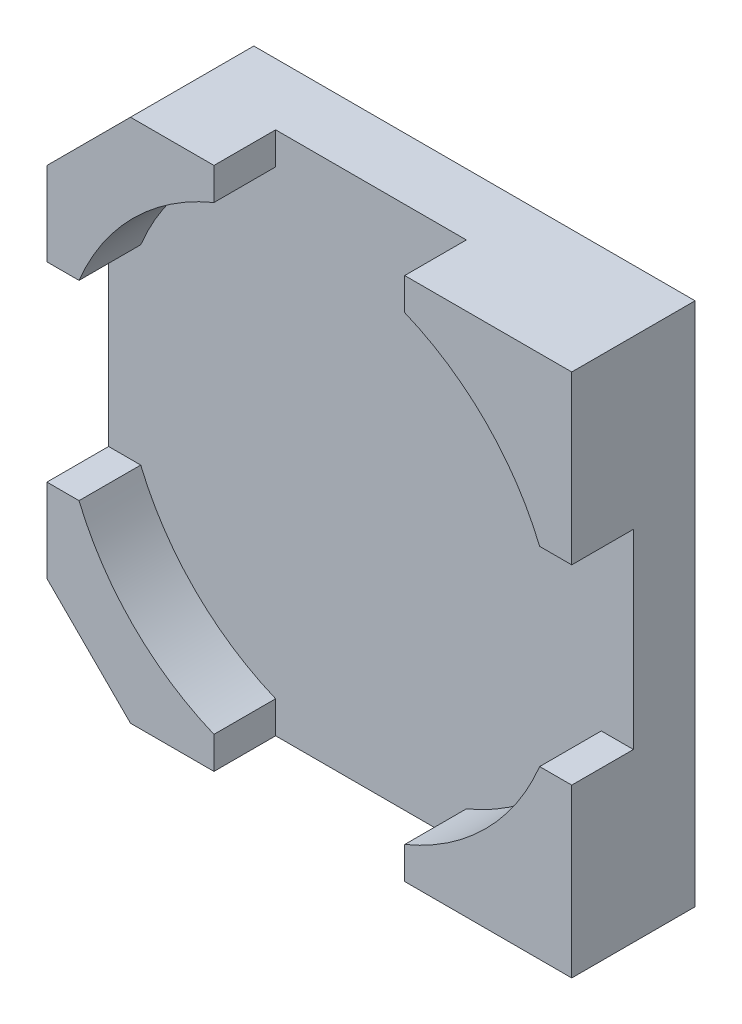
ISO-10303-21;
HEADER;
FILE_DESCRIPTION(('STEP AP214'),'2;1');
FILE_NAME('part.step','',(''),(''),'','','');
FILE_SCHEMA(('AUTOMOTIVE_DESIGN { 1 0 10303 214 1 1 1 1 }'));
ENDSEC;
DATA;
#1=APPLICATION_CONTEXT('core data for automotive mechanical design processes');
#2=APPLICATION_PROTOCOL_DEFINITION('international standard','automotive_design',2000,#1);
#3=PRODUCT_CONTEXT('',#1,'mechanical');
#4=PRODUCT('Part','Part','',(#3));
#5=PRODUCT_RELATED_PRODUCT_CATEGORY('part','',(#4));
#6=PRODUCT_DEFINITION_FORMATION('','',#4);
#7=PRODUCT_DEFINITION_CONTEXT('part definition',#1,'design');
#8=PRODUCT_DEFINITION('design','',#6,#7);
#9=PRODUCT_DEFINITION_SHAPE('','',#8);
#10=(LENGTH_UNIT() NAMED_UNIT(*) SI_UNIT(.MILLI.,.METRE.));
#11=(NAMED_UNIT(*) PLANE_ANGLE_UNIT() SI_UNIT($,.RADIAN.));
#12=(NAMED_UNIT(*) SI_UNIT($,.STERADIAN.) SOLID_ANGLE_UNIT());
#13=UNCERTAINTY_MEASURE_WITH_UNIT(LENGTH_MEASURE(1.E-05),#10,'distance_accuracy_value','');
#14=(GEOMETRIC_REPRESENTATION_CONTEXT(3) GLOBAL_UNCERTAINTY_ASSIGNED_CONTEXT((#13)) GLOBAL_UNIT_ASSIGNED_CONTEXT((#10,
#11,#12)) REPRESENTATION_CONTEXT('',''));
#15=CARTESIAN_POINT('',(0.,0.,0.));
#16=DIRECTION('',(0.,0.,1.));
#17=DIRECTION('',(1.,0.,0.));
#18=AXIS2_PLACEMENT_3D('',#15,#16,#17);
#19=CARTESIAN_POINT('',(-2.987,1.237,1.651));
#20=DIRECTION('',(0.,0.,1.));
#21=DIRECTION('',(1.,0.,0.));
#22=AXIS2_PLACEMENT_3D('',#19,#20,#21);
#23=PLANE('',#22);
#24=DIRECTION('',(1.,0.,0.));
#25=VECTOR('',#24,1.);
#26=CARTESIAN_POINT('',(-2.987,1.237,1.651));
#27=LINE('',#26,#25);
#28=CARTESIAN_POINT('',(-3.404,1.237,1.651));
#29=VERTEX_POINT('',#28);
#30=CARTESIAN_POINT('',(-2.98744638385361,1.237,1.651));
#31=VERTEX_POINT('',#30);
#32=EDGE_CURVE('E163',#29,#31,#27,.T.);
#33=ORIENTED_EDGE('',*,*,#32,.T.);
#34=CARTESIAN_POINT('',(0.,0.,1.651));
#35=DIRECTION('',(0.,0.,1.));
#36=DIRECTION('',(1.,0.,0.));
#37=AXIS2_PLACEMENT_3D('',#34,#35,#36);
#38=CIRCLE('',#37,3.23342);
#39=CARTESIAN_POINT('',(-1.237,2.98744638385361,1.651));
#40=VERTEX_POINT('',#39);
#41=EDGE_CURVE('E20',#31,#40,#38,.F.);
#42=ORIENTED_EDGE('',*,*,#41,.T.);
#43=DIRECTION('',(0.,1.,0.));
#44=VECTOR('',#43,1.);
#45=CARTESIAN_POINT('',(-1.237,1.237,1.651));
#46=LINE('',#45,#44);
#47=CARTESIAN_POINT('',(-1.237,3.404,1.651));
#48=VERTEX_POINT('',#47);
#49=EDGE_CURVE('E169',#40,#48,#46,.T.);
#50=ORIENTED_EDGE('',*,*,#49,.T.);
#51=DIRECTION('',(1.,0.,0.));
#52=VECTOR('',#51,1.);
#53=CARTESIAN_POINT('',(-2.987,3.404,1.651));
#54=LINE('',#53,#52);
#55=CARTESIAN_POINT('',(-2.32,3.404,1.651));
#56=VERTEX_POINT('',#55);
#57=EDGE_CURVE('E177',#48,#56,#54,.F.);
#58=ORIENTED_EDGE('',*,*,#57,.T.);
#59=DIRECTION('',(-0.707106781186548,-0.707106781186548,0.));
#60=VECTOR('',#59,1.);
#61=CARTESIAN_POINT('',(-2.32,3.404,1.651));
#62=LINE('',#61,#60);
#63=CARTESIAN_POINT('',(-3.404,2.32,1.651));
#64=VERTEX_POINT('',#63);
#65=EDGE_CURVE('E252',#56,#64,#62,.T.);
#66=ORIENTED_EDGE('',*,*,#65,.T.);
#67=DIRECTION('',(0.,1.,0.));
#68=VECTOR('',#67,1.);
#69=CARTESIAN_POINT('',(-3.404,1.237,1.651));
#70=LINE('',#69,#68);
#71=EDGE_CURVE('E263',#64,#29,#70,.F.);
#72=ORIENTED_EDGE('',*,*,#71,.T.);
#73=EDGE_LOOP('',(#33,#42,#50,#58,#66,#72));
#74=FACE_BOUND('',#73,.T.);
#75=ADVANCED_FACE('F17',(#74),#23,.T.);
#76=CARTESIAN_POINT('',(-1.237,-2.987,1.651));
#77=DIRECTION('',(0.,0.,1.));
#78=DIRECTION('',(1.,0.,0.));
#79=AXIS2_PLACEMENT_3D('',#76,#77,#78);
#80=PLANE('',#79);
#81=DIRECTION('',(0.,1.,0.));
#82=VECTOR('',#81,1.);
#83=CARTESIAN_POINT('',(-1.237,-2.987,1.651));
#84=LINE('',#83,#82);
#85=CARTESIAN_POINT('',(-1.237,-3.404,1.651));
#86=VERTEX_POINT('',#85);
#87=CARTESIAN_POINT('',(-1.237,-2.98744638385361,1.651));
#88=VERTEX_POINT('',#87);
#89=EDGE_CURVE('E181',#86,#88,#84,.T.);
#90=ORIENTED_EDGE('',*,*,#89,.T.);
#91=CARTESIAN_POINT('',(0.,0.,1.651));
#92=DIRECTION('',(0.,0.,1.));
#93=DIRECTION('',(1.,0.,0.));
#94=AXIS2_PLACEMENT_3D('',#91,#92,#93);
#95=CIRCLE('',#94,3.23342);
#96=CARTESIAN_POINT('',(-2.98744638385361,-1.237,1.651));
#97=VERTEX_POINT('',#96);
#98=EDGE_CURVE('E188',#88,#97,#95,.F.);
#99=ORIENTED_EDGE('',*,*,#98,.T.);
#100=DIRECTION('',(1.,0.,0.));
#101=VECTOR('',#100,1.);
#102=CARTESIAN_POINT('',(-1.237,-1.237,1.651));
#103=LINE('',#102,#101);
#104=CARTESIAN_POINT('',(-3.404,-1.237,1.651));
#105=VERTEX_POINT('',#104);
#106=EDGE_CURVE('E282',#97,#105,#103,.F.);
#107=ORIENTED_EDGE('',*,*,#106,.T.);
#108=DIRECTION('',(0.,1.,0.));
#109=VECTOR('',#108,1.);
#110=CARTESIAN_POINT('',(-3.404,-2.987,1.651));
#111=LINE('',#110,#109);
#112=CARTESIAN_POINT('',(-3.404,-2.32,1.651));
#113=VERTEX_POINT('',#112);
#114=EDGE_CURVE('E278',#105,#113,#111,.F.);
#115=ORIENTED_EDGE('',*,*,#114,.T.);
#116=DIRECTION('',(0.707106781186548,-0.707106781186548,0.));
#117=VECTOR('',#116,1.);
#118=CARTESIAN_POINT('',(-3.404,-2.32,1.651));
#119=LINE('',#118,#117);
#120=CARTESIAN_POINT('',(-2.32,-3.404,1.651));
#121=VERTEX_POINT('',#120);
#122=EDGE_CURVE('E281',#113,#121,#119,.T.);
#123=ORIENTED_EDGE('',*,*,#122,.T.);
#124=DIRECTION('',(1.,0.,0.));
#125=VECTOR('',#124,1.);
#126=CARTESIAN_POINT('',(-1.237,-3.404,1.651));
#127=LINE('',#126,#125);
#128=EDGE_CURVE('E294',#121,#86,#127,.T.);
#129=ORIENTED_EDGE('',*,*,#128,.T.);
#130=EDGE_LOOP('',(#90,#99,#107,#115,#123,#129));
#131=FACE_BOUND('',#130,.T.);
#132=ADVANCED_FACE('F461',(#131),#80,.T.);
#133=CARTESIAN_POINT('',(0.,0.,0.851));
#134=DIRECTION('',(0.,0.,1.));
#135=DIRECTION('',(1.,0.,0.));
#136=AXIS2_PLACEMENT_3D('',#133,#134,#135);
#137=CYLINDRICAL_SURFACE('',#136,3.23342);
#138=CARTESIAN_POINT('',(0.,0.,0.851));
#139=DIRECTION('',(0.,0.,1.));
#140=DIRECTION('',(1.,0.,0.));
#141=AXIS2_PLACEMENT_3D('',#138,#139,#140);
#142=CIRCLE('',#141,3.23342);
#143=CARTESIAN_POINT('',(-1.23707889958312,2.98719051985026,0.851));
#144=VERTEX_POINT('',#143);
#145=CARTESIAN_POINT('',(-2.98719051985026,1.23707889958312,0.851));
#146=VERTEX_POINT('',#145);
#147=EDGE_CURVE('E184',#144,#146,#142,.T.);
#148=ORIENTED_EDGE('',*,*,#147,.F.);
#149=DIRECTION('',(0.,0.,1.));
#150=VECTOR('',#149,1.);
#151=CARTESIAN_POINT('',(-1.237,2.98744638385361,1.651));
#152=LINE('',#151,#150);
#153=EDGE_CURVE('E172',#40,#144,#152,.F.);
#154=ORIENTED_EDGE('',*,*,#153,.F.);
#155=ORIENTED_EDGE('',*,*,#41,.F.);
#156=DIRECTION('',(0.,0.,1.));
#157=VECTOR('',#156,1.);
#158=CARTESIAN_POINT('',(-2.98744638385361,1.237,0.851));
#159=LINE('',#158,#157);
#160=EDGE_CURVE('E186',#146,#31,#159,.T.);
#161=ORIENTED_EDGE('',*,*,#160,.F.);
#162=EDGE_LOOP('',(#148,#154,#155,#161));
#163=FACE_BOUND('',#162,.T.);
#164=ADVANCED_FACE('F182',(#163),#137,.F.);
#165=CARTESIAN_POINT('',(0.,0.,0.851));
#166=DIRECTION('',(0.,0.,1.));
#167=DIRECTION('',(1.,0.,0.));
#168=AXIS2_PLACEMENT_3D('',#165,#166,#167);
#169=CYLINDRICAL_SURFACE('',#168,3.23342);
#170=CARTESIAN_POINT('',(0.,0.,0.851));
#171=DIRECTION('',(0.,0.,1.));
#172=DIRECTION('',(1.,0.,0.));
#173=AXIS2_PLACEMENT_3D('',#170,#171,#172);
#174=CIRCLE('',#173,3.23342);
#175=CARTESIAN_POINT('',(-2.98719051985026,-1.23707889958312,0.851));
#176=VERTEX_POINT('',#175);
#177=CARTESIAN_POINT('',(-1.23707889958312,-2.98719051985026,0.851));
#178=VERTEX_POINT('',#177);
#179=EDGE_CURVE('E226',#176,#178,#174,.T.);
#180=ORIENTED_EDGE('',*,*,#179,.F.);
#181=DIRECTION('',(0.,0.,1.));
#182=VECTOR('',#181,1.);
#183=CARTESIAN_POINT('',(-2.98744638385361,-1.237,1.651));
#184=LINE('',#183,#182);
#185=EDGE_CURVE('E196',#97,#176,#184,.F.);
#186=ORIENTED_EDGE('',*,*,#185,.F.);
#187=ORIENTED_EDGE('',*,*,#98,.F.);
#188=DIRECTION('',(0.,0.,1.));
#189=VECTOR('',#188,1.);
#190=CARTESIAN_POINT('',(-1.237,-2.98744638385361,0.851));
#191=LINE('',#190,#189);
#192=EDGE_CURVE('E200',#178,#88,#191,.T.);
#193=ORIENTED_EDGE('',*,*,#192,.F.);
#194=EDGE_LOOP('',(#180,#186,#187,#193));
#195=FACE_BOUND('',#194,.T.);
#196=ADVANCED_FACE('F540',(#195),#169,.F.);
#197=CARTESIAN_POINT('',(0.,0.,0.851));
#198=DIRECTION('',(0.,0.,1.));
#199=DIRECTION('',(1.,0.,0.));
#200=AXIS2_PLACEMENT_3D('',#197,#198,#199);
#201=CYLINDRICAL_SURFACE('',#200,3.23342);
#202=CARTESIAN_POINT('',(0.,0.,0.851));
#203=DIRECTION('',(0.,0.,1.));
#204=DIRECTION('',(1.,0.,0.));
#205=AXIS2_PLACEMENT_3D('',#202,#203,#204);
#206=CIRCLE('',#205,3.23342);
#207=CARTESIAN_POINT('',(2.98719051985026,1.23707889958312,0.851));
#208=VERTEX_POINT('',#207);
#209=CARTESIAN_POINT('',(1.23707889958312,2.98719051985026,0.851));
#210=VERTEX_POINT('',#209);
#211=EDGE_CURVE('E218',#208,#210,#206,.T.);
#212=ORIENTED_EDGE('',*,*,#211,.F.);
#213=DIRECTION('',(0.,0.,1.));
#214=VECTOR('',#213,1.);
#215=CARTESIAN_POINT('',(2.98744638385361,1.237,1.651));
#216=LINE('',#215,#214);
#217=CARTESIAN_POINT('',(2.98744638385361,1.237,1.651));
#218=VERTEX_POINT('',#217);
#219=EDGE_CURVE('E205',#218,#208,#216,.F.);
#220=ORIENTED_EDGE('',*,*,#219,.F.);
#221=CARTESIAN_POINT('',(0.,0.,1.651));
#222=DIRECTION('',(0.,0.,1.));
#223=DIRECTION('',(1.,0.,0.));
#224=AXIS2_PLACEMENT_3D('',#221,#222,#223);
#225=CIRCLE('',#224,3.23342);
#226=CARTESIAN_POINT('',(1.237,2.98744638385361,1.651));
#227=VERTEX_POINT('',#226);
#228=EDGE_CURVE('E236',#227,#218,#225,.F.);
#229=ORIENTED_EDGE('',*,*,#228,.F.);
#230=DIRECTION('',(0.,0.,1.));
#231=VECTOR('',#230,1.);
#232=CARTESIAN_POINT('',(1.237,2.98744638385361,0.851));
#233=LINE('',#232,#231);
#234=EDGE_CURVE('E231',#210,#227,#233,.T.);
#235=ORIENTED_EDGE('',*,*,#234,.F.);
#236=EDGE_LOOP('',(#212,#220,#229,#235));
#237=FACE_BOUND('',#236,.T.);
#238=ADVANCED_FACE('F542',(#237),#201,.F.);
#239=CARTESIAN_POINT('',(0.,0.,0.851));
#240=DIRECTION('',(0.,0.,1.));
#241=DIRECTION('',(1.,0.,0.));
#242=AXIS2_PLACEMENT_3D('',#239,#240,#241);
#243=CYLINDRICAL_SURFACE('',#242,3.23342);
#244=CARTESIAN_POINT('',(0.,0.,0.851));
#245=DIRECTION('',(0.,0.,1.));
#246=DIRECTION('',(1.,0.,0.));
#247=AXIS2_PLACEMENT_3D('',#244,#245,#246);
#248=CIRCLE('',#247,3.23342);
#249=CARTESIAN_POINT('',(1.23707889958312,-2.98719051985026,0.851));
#250=VERTEX_POINT('',#249);
#251=CARTESIAN_POINT('',(2.98719051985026,-1.23707889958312,0.851));
#252=VERTEX_POINT('',#251);
#253=EDGE_CURVE('E213',#250,#252,#248,.T.);
#254=ORIENTED_EDGE('',*,*,#253,.F.);
#255=DIRECTION('',(0.,0.,1.));
#256=VECTOR('',#255,1.);
#257=CARTESIAN_POINT('',(1.237,-2.98744638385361,1.651));
#258=LINE('',#257,#256);
#259=CARTESIAN_POINT('',(1.237,-2.98744638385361,1.651));
#260=VERTEX_POINT('',#259);
#261=EDGE_CURVE('E209',#260,#250,#258,.F.);
#262=ORIENTED_EDGE('',*,*,#261,.F.);
#263=CARTESIAN_POINT('',(0.,0.,1.651));
#264=DIRECTION('',(0.,0.,1.));
#265=DIRECTION('',(1.,0.,0.));
#266=AXIS2_PLACEMENT_3D('',#263,#264,#265);
#267=CIRCLE('',#266,3.23342);
#268=CARTESIAN_POINT('',(2.98744638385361,-1.237,1.651));
#269=VERTEX_POINT('',#268);
#270=EDGE_CURVE('E245',#269,#260,#267,.F.);
#271=ORIENTED_EDGE('',*,*,#270,.F.);
#272=DIRECTION('',(0.,0.,1.));
#273=VECTOR('',#272,1.);
#274=CARTESIAN_POINT('',(2.98744638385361,-1.237,0.851));
#275=LINE('',#274,#273);
#276=EDGE_CURVE('E242',#252,#269,#275,.T.);
#277=ORIENTED_EDGE('',*,*,#276,.F.);
#278=EDGE_LOOP('',(#254,#262,#271,#277));
#279=FACE_BOUND('',#278,.T.);
#280=ADVANCED_FACE('F548',(#279),#243,.F.);
#281=CARTESIAN_POINT('',(-1.237,2.987,0.851));
#282=DIRECTION('',(1.,0.,0.));
#283=DIRECTION('',(0.,0.,-1.));
#284=AXIS2_PLACEMENT_3D('',#281,#282,#283);
#285=PLANE('',#284);
#286=ORIENTED_EDGE('',*,*,#49,.F.);
#287=ORIENTED_EDGE('',*,*,#153,.T.);
#288=DIRECTION('',(0.,1.,0.));
#289=VECTOR('',#288,1.);
#290=CARTESIAN_POINT('',(-1.237,-3.404,0.851));
#291=LINE('',#290,#289);
#292=CARTESIAN_POINT('',(-1.237,3.404,0.851));
#293=VERTEX_POINT('',#292);
#294=EDGE_CURVE('E393',#293,#144,#291,.F.);
#295=ORIENTED_EDGE('',*,*,#294,.F.);
#296=DIRECTION('',(0.,0.,1.));
#297=VECTOR('',#296,1.);
#298=CARTESIAN_POINT('',(-1.237,3.404,0.051));
#299=LINE('',#298,#297);
#300=EDGE_CURVE('E175',#48,#293,#299,.F.);
#301=ORIENTED_EDGE('',*,*,#300,.F.);
#302=EDGE_LOOP('',(#286,#287,#295,#301));
#303=FACE_BOUND('',#302,.T.);
#304=ADVANCED_FACE('F170',(#303),#285,.T.);
#305=CARTESIAN_POINT('',(1.237,3.404,0.851));
#306=DIRECTION('',(-1.,0.,0.));
#307=DIRECTION('',(0.,0.,1.));
#308=AXIS2_PLACEMENT_3D('',#305,#306,#307);
#309=PLANE('',#308);
#310=DIRECTION('',(0.,1.,0.));
#311=VECTOR('',#310,1.);
#312=CARTESIAN_POINT('',(1.237,1.237,1.651));
#313=LINE('',#312,#311);
#314=CARTESIAN_POINT('',(1.237,3.404,1.651));
#315=VERTEX_POINT('',#314);
#316=EDGE_CURVE('E235',#315,#227,#313,.F.);
#317=ORIENTED_EDGE('',*,*,#316,.F.);
#318=DIRECTION('',(0.,0.,1.));
#319=VECTOR('',#318,1.);
#320=CARTESIAN_POINT('',(1.237,3.404,0.051));
#321=LINE('',#320,#319);
#322=CARTESIAN_POINT('',(1.237,3.404,0.851));
#323=VERTEX_POINT('',#322);
#324=EDGE_CURVE('E323',#323,#315,#321,.T.);
#325=ORIENTED_EDGE('',*,*,#324,.F.);
#326=DIRECTION('',(0.,1.,0.));
#327=VECTOR('',#326,1.);
#328=CARTESIAN_POINT('',(1.237,-3.404,0.851));
#329=LINE('',#328,#327);
#330=EDGE_CURVE('E391',#210,#323,#329,.T.);
#331=ORIENTED_EDGE('',*,*,#330,.F.);
#332=ORIENTED_EDGE('',*,*,#234,.T.);
#333=EDGE_LOOP('',(#317,#325,#331,#332));
#334=FACE_BOUND('',#333,.T.);
#335=ADVANCED_FACE('F600',(#334),#309,.T.);
#336=CARTESIAN_POINT('',(2.987,1.237,1.651));
#337=DIRECTION('',(0.,0.,1.));
#338=DIRECTION('',(1.,0.,0.));
#339=AXIS2_PLACEMENT_3D('',#336,#337,#338);
#340=PLANE('',#339);
#341=ORIENTED_EDGE('',*,*,#316,.T.);
#342=ORIENTED_EDGE('',*,*,#228,.T.);
#343=DIRECTION('',(1.,0.,0.));
#344=VECTOR('',#343,1.);
#345=CARTESIAN_POINT('',(2.987,1.237,1.651));
#346=LINE('',#345,#344);
#347=CARTESIAN_POINT('',(3.404,1.237,1.651));
#348=VERTEX_POINT('',#347);
#349=EDGE_CURVE('E239',#348,#218,#346,.F.);
#350=ORIENTED_EDGE('',*,*,#349,.F.);
#351=DIRECTION('',(0.,1.,0.));
#352=VECTOR('',#351,1.);
#353=CARTESIAN_POINT('',(3.404,-3.404,1.651));
#354=LINE('',#353,#352);
#355=CARTESIAN_POINT('',(3.404,3.404,1.651));
#356=VERTEX_POINT('',#355);
#357=EDGE_CURVE('E334',#356,#348,#354,.F.);
#358=ORIENTED_EDGE('',*,*,#357,.F.);
#359=DIRECTION('',(1.,0.,0.));
#360=VECTOR('',#359,1.);
#361=CARTESIAN_POINT('',(3.404,3.404,1.651));
#362=LINE('',#361,#360);
#363=EDGE_CURVE('E326',#315,#356,#362,.T.);
#364=ORIENTED_EDGE('',*,*,#363,.F.);
#365=EDGE_LOOP('',(#341,#342,#350,#358,#364));
#366=FACE_BOUND('',#365,.T.);
#367=ADVANCED_FACE('F520',(#366),#340,.T.);
#368=CARTESIAN_POINT('',(2.987,1.237,0.851));
#369=DIRECTION('',(0.,-1.,0.));
#370=DIRECTION('',(0.,0.,-1.));
#371=AXIS2_PLACEMENT_3D('',#368,#369,#370);
#372=PLANE('',#371);
#373=ORIENTED_EDGE('',*,*,#349,.T.);
#374=ORIENTED_EDGE('',*,*,#219,.T.);
#375=DIRECTION('',(1.,0.,0.));
#376=VECTOR('',#375,1.);
#377=CARTESIAN_POINT('',(-1.237,1.237,0.851));
#378=LINE('',#377,#376);
#379=CARTESIAN_POINT('',(3.404,1.237,0.851));
#380=VERTEX_POINT('',#379);
#381=EDGE_CURVE('E376',#380,#208,#378,.F.);
#382=ORIENTED_EDGE('',*,*,#381,.F.);
#383=DIRECTION('',(0.,0.,-1.));
#384=VECTOR('',#383,1.);
#385=CARTESIAN_POINT('',(3.404,1.237,0.051));
#386=LINE('',#385,#384);
#387=EDGE_CURVE('E337',#348,#380,#386,.T.);
#388=ORIENTED_EDGE('',*,*,#387,.F.);
#389=EDGE_LOOP('',(#373,#374,#382,#388));
#390=FACE_BOUND('',#389,.T.);
#391=ADVANCED_FACE('F524',(#390),#372,.T.);
#392=CARTESIAN_POINT('',(3.404,-1.237,0.851));
#393=DIRECTION('',(0.,1.,0.));
#394=DIRECTION('',(0.,0.,1.));
#395=AXIS2_PLACEMENT_3D('',#392,#393,#394);
#396=PLANE('',#395);
#397=DIRECTION('',(1.,0.,0.));
#398=VECTOR('',#397,1.);
#399=CARTESIAN_POINT('',(1.237,-1.237,1.651));
#400=LINE('',#399,#398);
#401=CARTESIAN_POINT('',(3.404,-1.237,1.651));
#402=VERTEX_POINT('',#401);
#403=EDGE_CURVE('E244',#402,#269,#400,.F.);
#404=ORIENTED_EDGE('',*,*,#403,.F.);
#405=DIRECTION('',(0.,0.,-1.));
#406=VECTOR('',#405,1.);
#407=CARTESIAN_POINT('',(3.404,-1.237,0.051));
#408=LINE('',#407,#406);
#409=CARTESIAN_POINT('',(3.404,-1.237,0.851));
#410=VERTEX_POINT('',#409);
#411=EDGE_CURVE('E344',#410,#402,#408,.F.);
#412=ORIENTED_EDGE('',*,*,#411,.F.);
#413=DIRECTION('',(1.,0.,0.));
#414=VECTOR('',#413,1.);
#415=CARTESIAN_POINT('',(-1.237,-1.237,0.851));
#416=LINE('',#415,#414);
#417=EDGE_CURVE('E374',#252,#410,#416,.T.);
#418=ORIENTED_EDGE('',*,*,#417,.F.);
#419=ORIENTED_EDGE('',*,*,#276,.T.);
#420=EDGE_LOOP('',(#404,#412,#418,#419));
#421=FACE_BOUND('',#420,.T.);
#422=ADVANCED_FACE('F529',(#421),#396,.T.);
#423=CARTESIAN_POINT('',(1.237,-2.987,1.651));
#424=DIRECTION('',(0.,0.,1.));
#425=DIRECTION('',(1.,0.,0.));
#426=AXIS2_PLACEMENT_3D('',#423,#424,#425);
#427=PLANE('',#426);
#428=ORIENTED_EDGE('',*,*,#403,.T.);
#429=ORIENTED_EDGE('',*,*,#270,.T.);
#430=DIRECTION('',(0.,1.,0.));
#431=VECTOR('',#430,1.);
#432=CARTESIAN_POINT('',(1.237,-2.987,1.651));
#433=LINE('',#432,#431);
#434=CARTESIAN_POINT('',(1.237,-3.404,1.651));
#435=VERTEX_POINT('',#434);
#436=EDGE_CURVE('E248',#435,#260,#433,.T.);
#437=ORIENTED_EDGE('',*,*,#436,.F.);
#438=DIRECTION('',(1.,0.,0.));
#439=VECTOR('',#438,1.);
#440=CARTESIAN_POINT('',(-2.32,-3.404,1.651));
#441=LINE('',#440,#439);
#442=CARTESIAN_POINT('',(3.404,-3.404,1.651));
#443=VERTEX_POINT('',#442);
#444=EDGE_CURVE('E355',#443,#435,#441,.F.);
#445=ORIENTED_EDGE('',*,*,#444,.F.);
#446=DIRECTION('',(0.,1.,0.));
#447=VECTOR('',#446,1.);
#448=CARTESIAN_POINT('',(3.404,-3.404,1.651));
#449=LINE('',#448,#447);
#450=EDGE_CURVE('E347',#402,#443,#449,.F.);
#451=ORIENTED_EDGE('',*,*,#450,.F.);
#452=EDGE_LOOP('',(#428,#429,#437,#445,#451));
#453=FACE_BOUND('',#452,.T.);
#454=ADVANCED_FACE('F513',(#453),#427,.T.);
#455=CARTESIAN_POINT('',(1.237,-2.987,0.851));
#456=DIRECTION('',(-1.,0.,0.));
#457=DIRECTION('',(0.,0.,1.));
#458=AXIS2_PLACEMENT_3D('',#455,#456,#457);
#459=PLANE('',#458);
#460=ORIENTED_EDGE('',*,*,#436,.T.);
#461=ORIENTED_EDGE('',*,*,#261,.T.);
#462=DIRECTION('',(0.,1.,0.));
#463=VECTOR('',#462,1.);
#464=CARTESIAN_POINT('',(1.237,-3.404,0.851));
#465=LINE('',#464,#463);
#466=CARTESIAN_POINT('',(1.237,-3.404,0.851));
#467=VERTEX_POINT('',#466);
#468=EDGE_CURVE('E363',#467,#250,#465,.T.);
#469=ORIENTED_EDGE('',*,*,#468,.F.);
#470=DIRECTION('',(0.,0.,-1.));
#471=VECTOR('',#470,1.);
#472=CARTESIAN_POINT('',(1.237,-3.404,0.051));
#473=LINE('',#472,#471);
#474=EDGE_CURVE('E358',#435,#467,#473,.T.);
#475=ORIENTED_EDGE('',*,*,#474,.F.);
#476=EDGE_LOOP('',(#460,#461,#469,#475));
#477=FACE_BOUND('',#476,.T.);
#478=ADVANCED_FACE('F533',(#477),#459,.T.);
#479=CARTESIAN_POINT('',(-1.237,-3.404,0.851));
#480=DIRECTION('',(1.,0.,0.));
#481=DIRECTION('',(0.,0.,-1.));
#482=AXIS2_PLACEMENT_3D('',#479,#480,#481);
#483=PLANE('',#482);
#484=ORIENTED_EDGE('',*,*,#89,.F.);
#485=DIRECTION('',(0.,0.,-1.));
#486=VECTOR('',#485,1.);
#487=CARTESIAN_POINT('',(-1.237,-3.404,0.051));
#488=LINE('',#487,#486);
#489=CARTESIAN_POINT('',(-1.237,-3.404,0.851));
#490=VERTEX_POINT('',#489);
#491=EDGE_CURVE('E299',#490,#86,#488,.F.);
#492=ORIENTED_EDGE('',*,*,#491,.F.);
#493=DIRECTION('',(0.,1.,0.));
#494=VECTOR('',#493,1.);
#495=CARTESIAN_POINT('',(-1.237,-3.404,0.851));
#496=LINE('',#495,#494);
#497=EDGE_CURVE('E410',#178,#490,#496,.F.);
#498=ORIENTED_EDGE('',*,*,#497,.F.);
#499=ORIENTED_EDGE('',*,*,#192,.T.);
#500=EDGE_LOOP('',(#484,#492,#498,#499));
#501=FACE_BOUND('',#500,.T.);
#502=ADVANCED_FACE('F538',(#501),#483,.T.);
#503=CARTESIAN_POINT('',(-2.987,-1.237,0.851));
#504=DIRECTION('',(0.,1.,0.));
#505=DIRECTION('',(0.,0.,1.));
#506=AXIS2_PLACEMENT_3D('',#503,#504,#505);
#507=PLANE('',#506);
#508=ORIENTED_EDGE('',*,*,#106,.F.);
#509=ORIENTED_EDGE('',*,*,#185,.T.);
#510=DIRECTION('',(1.,0.,0.));
#511=VECTOR('',#510,1.);
#512=CARTESIAN_POINT('',(-1.237,-1.237,0.851));
#513=LINE('',#512,#511);
#514=CARTESIAN_POINT('',(-3.404,-1.237,0.851));
#515=VERTEX_POINT('',#514);
#516=EDGE_CURVE('E414',#515,#176,#513,.T.);
#517=ORIENTED_EDGE('',*,*,#516,.F.);
#518=DIRECTION('',(0.,0.,1.));
#519=VECTOR('',#518,1.);
#520=CARTESIAN_POINT('',(-3.404,-1.237,0.051));
#521=LINE('',#520,#519);
#522=EDGE_CURVE('E288',#105,#515,#521,.F.);
#523=ORIENTED_EDGE('',*,*,#522,.F.);
#524=EDGE_LOOP('',(#508,#509,#517,#523));
#525=FACE_BOUND('',#524,.T.);
#526=ADVANCED_FACE('F465',(#525),#507,.T.);
#527=CARTESIAN_POINT('',(-1.237,-3.404,0.851));
#528=DIRECTION('',(0.,0.,1.));
#529=DIRECTION('',(1.,0.,0.));
#530=AXIS2_PLACEMENT_3D('',#527,#528,#529);
#531=PLANE('',#530);
#532=ORIENTED_EDGE('',*,*,#516,.T.);
#533=ORIENTED_EDGE('',*,*,#179,.T.);
#534=ORIENTED_EDGE('',*,*,#497,.T.);
#535=DIRECTION('',(1.,0.,0.));
#536=VECTOR('',#535,1.);
#537=CARTESIAN_POINT('',(-2.32,-3.404,0.851));
#538=LINE('',#537,#536);
#539=EDGE_CURVE('E308',#467,#490,#538,.F.);
#540=ORIENTED_EDGE('',*,*,#539,.F.);
#541=ORIENTED_EDGE('',*,*,#468,.T.);
#542=ORIENTED_EDGE('',*,*,#253,.T.);
#543=ORIENTED_EDGE('',*,*,#417,.T.);
#544=DIRECTION('',(0.,1.,0.));
#545=VECTOR('',#544,1.);
#546=CARTESIAN_POINT('',(3.404,-3.404,0.851));
#547=LINE('',#546,#545);
#548=EDGE_CURVE('E348',#380,#410,#547,.F.);
#549=ORIENTED_EDGE('',*,*,#548,.F.);
#550=ORIENTED_EDGE('',*,*,#381,.T.);
#551=ORIENTED_EDGE('',*,*,#211,.T.);
#552=ORIENTED_EDGE('',*,*,#330,.T.);
#553=DIRECTION('',(1.,0.,0.));
#554=VECTOR('',#553,1.);
#555=CARTESIAN_POINT('',(3.404,3.404,0.851));
#556=LINE('',#555,#554);
#557=EDGE_CURVE('E327',#293,#323,#556,.T.);
#558=ORIENTED_EDGE('',*,*,#557,.F.);
#559=ORIENTED_EDGE('',*,*,#294,.T.);
#560=ORIENTED_EDGE('',*,*,#147,.T.);
#561=DIRECTION('',(1.,0.,0.));
#562=VECTOR('',#561,1.);
#563=CARTESIAN_POINT('',(-3.404,1.237,0.851));
#564=LINE('',#563,#562);
#565=CARTESIAN_POINT('',(-3.404,1.237,0.851));
#566=VERTEX_POINT('',#565);
#567=EDGE_CURVE('E401',#566,#146,#564,.T.);
#568=ORIENTED_EDGE('',*,*,#567,.F.);
#569=DIRECTION('',(0.,1.,0.));
#570=VECTOR('',#569,1.);
#571=CARTESIAN_POINT('',(-3.404,2.32,0.851));
#572=LINE('',#571,#570);
#573=EDGE_CURVE('E275',#515,#566,#572,.T.);
#574=ORIENTED_EDGE('',*,*,#573,.F.);
#575=EDGE_LOOP('',(#532,#533,#534,#540,#541,#542,#543,#549,#550,#551,#552,#558,#559,#560,#568,#574));
#576=FACE_BOUND('',#575,.T.);
#577=ADVANCED_FACE('F470',(#576),#531,.T.);
#578=CARTESIAN_POINT('',(-3.404,1.237,0.851));
#579=DIRECTION('',(0.,-1.,0.));
#580=DIRECTION('',(0.,0.,-1.));
#581=AXIS2_PLACEMENT_3D('',#578,#579,#580);
#582=PLANE('',#581);
#583=ORIENTED_EDGE('',*,*,#32,.F.);
#584=DIRECTION('',(0.,0.,1.));
#585=VECTOR('',#584,1.);
#586=CARTESIAN_POINT('',(-3.404,1.237,0.051));
#587=LINE('',#586,#585);
#588=EDGE_CURVE('E267',#566,#29,#587,.T.);
#589=ORIENTED_EDGE('',*,*,#588,.F.);
#590=ORIENTED_EDGE('',*,*,#567,.T.);
#591=ORIENTED_EDGE('',*,*,#160,.T.);
#592=EDGE_LOOP('',(#583,#589,#590,#591));
#593=FACE_BOUND('',#592,.T.);
#594=ADVANCED_FACE('F472',(#593),#582,.T.);
#595=CARTESIAN_POINT('',(3.404,3.404,0.051));
#596=DIRECTION('',(0.,1.,0.));
#597=DIRECTION('',(0.,0.,1.));
#598=AXIS2_PLACEMENT_3D('',#595,#596,#597);
#599=PLANE('',#598);
#600=ORIENTED_EDGE('',*,*,#363,.T.);
#601=DIRECTION('',(0.,0.,-1.));
#602=VECTOR('',#601,1.);
#603=CARTESIAN_POINT('',(3.404,3.404,0.051));
#604=LINE('',#603,#602);
#605=CARTESIAN_POINT('',(3.404,3.404,0.051));
#606=VERTEX_POINT('',#605);
#607=EDGE_CURVE('E331',#606,#356,#604,.F.);
#608=ORIENTED_EDGE('',*,*,#607,.F.);
#609=DIRECTION('',(-1.,0.,0.));
#610=VECTOR('',#609,1.);
#611=CARTESIAN_POINT('',(-2.32,3.404,0.051));
#612=LINE('',#611,#610);
#613=CARTESIAN_POINT('',(-2.32,3.404,0.051));
#614=VERTEX_POINT('',#613);
#615=EDGE_CURVE('E258',#614,#606,#612,.F.);
#616=ORIENTED_EDGE('',*,*,#615,.F.);
#617=DIRECTION('',(0.,0.,1.));
#618=VECTOR('',#617,1.);
#619=CARTESIAN_POINT('',(-2.32,3.404,0.051));
#620=LINE('',#619,#618);
#621=EDGE_CURVE('E255',#56,#614,#620,.F.);
#622=ORIENTED_EDGE('',*,*,#621,.F.);
#623=ORIENTED_EDGE('',*,*,#57,.F.);
#624=ORIENTED_EDGE('',*,*,#300,.T.);
#625=ORIENTED_EDGE('',*,*,#557,.T.);
#626=ORIENTED_EDGE('',*,*,#324,.T.);
#627=EDGE_LOOP('',(#600,#608,#616,#622,#623,#624,#625,#626));
#628=FACE_BOUND('',#627,.T.);
#629=ADVANCED_FACE('F474',(#628),#599,.T.);
#630=CARTESIAN_POINT('',(3.404,-3.404,0.051));
#631=DIRECTION('',(1.,0.,0.));
#632=DIRECTION('',(0.,0.,-1.));
#633=AXIS2_PLACEMENT_3D('',#630,#631,#632);
#634=PLANE('',#633);
#635=ORIENTED_EDGE('',*,*,#450,.T.);
#636=DIRECTION('',(0.,0.,-1.));
#637=VECTOR('',#636,1.);
#638=CARTESIAN_POINT('',(3.404,-3.404,0.051));
#639=LINE('',#638,#637);
#640=CARTESIAN_POINT('',(3.404,-3.404,0.051));
#641=VERTEX_POINT('',#640);
#642=EDGE_CURVE('E352',#641,#443,#639,.F.);
#643=ORIENTED_EDGE('',*,*,#642,.F.);
#644=DIRECTION('',(0.,1.,0.));
#645=VECTOR('',#644,1.);
#646=CARTESIAN_POINT('',(3.404,3.404,0.051));
#647=LINE('',#646,#645);
#648=EDGE_CURVE('E444',#606,#641,#647,.F.);
#649=ORIENTED_EDGE('',*,*,#648,.F.);
#650=ORIENTED_EDGE('',*,*,#607,.T.);
#651=ORIENTED_EDGE('',*,*,#357,.T.);
#652=ORIENTED_EDGE('',*,*,#387,.T.);
#653=ORIENTED_EDGE('',*,*,#548,.T.);
#654=ORIENTED_EDGE('',*,*,#411,.T.);
#655=EDGE_LOOP('',(#635,#643,#649,#650,#651,#652,#653,#654));
#656=FACE_BOUND('',#655,.T.);
#657=ADVANCED_FACE('F481',(#656),#634,.T.);
#658=CARTESIAN_POINT('',(-2.32,-3.404,0.051));
#659=DIRECTION('',(0.,-1.,0.));
#660=DIRECTION('',(0.,0.,-1.));
#661=AXIS2_PLACEMENT_3D('',#658,#659,#660);
#662=PLANE('',#661);
#663=ORIENTED_EDGE('',*,*,#128,.F.);
#664=DIRECTION('',(0.,0.,1.));
#665=VECTOR('',#664,1.);
#666=CARTESIAN_POINT('',(-2.32,-3.404,0.051));
#667=LINE('',#666,#665);
#668=CARTESIAN_POINT('',(-2.32,-3.404,0.051));
#669=VERTEX_POINT('',#668);
#670=EDGE_CURVE('E289',#669,#121,#667,.T.);
#671=ORIENTED_EDGE('',*,*,#670,.F.);
#672=DIRECTION('',(-1.,0.,0.));
#673=VECTOR('',#672,1.);
#674=CARTESIAN_POINT('',(-2.32,-3.404,0.051));
#675=LINE('',#674,#673);
#676=EDGE_CURVE('E447',#641,#669,#675,.T.);
#677=ORIENTED_EDGE('',*,*,#676,.F.);
#678=ORIENTED_EDGE('',*,*,#642,.T.);
#679=ORIENTED_EDGE('',*,*,#444,.T.);
#680=ORIENTED_EDGE('',*,*,#474,.T.);
#681=ORIENTED_EDGE('',*,*,#539,.T.);
#682=ORIENTED_EDGE('',*,*,#491,.T.);
#683=EDGE_LOOP('',(#663,#671,#677,#678,#679,#680,#681,#682));
#684=FACE_BOUND('',#683,.T.);
#685=ADVANCED_FACE('F499',(#684),#662,.T.);
#686=CARTESIAN_POINT('',(-3.404,-2.32,0.051));
#687=DIRECTION('',(-0.707106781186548,-0.707106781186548,0.));
#688=DIRECTION('',(0.707106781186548,-0.707106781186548,0.));
#689=AXIS2_PLACEMENT_3D('',#686,#687,#688);
#690=PLANE('',#689);
#691=ORIENTED_EDGE('',*,*,#122,.F.);
#692=DIRECTION('',(0.,0.,1.));
#693=VECTOR('',#692,1.);
#694=CARTESIAN_POINT('',(-3.404,-2.32,0.051));
#695=LINE('',#694,#693);
#696=CARTESIAN_POINT('',(-3.404,-2.32,0.051));
#697=VERTEX_POINT('',#696);
#698=EDGE_CURVE('E285',#697,#113,#695,.T.);
#699=ORIENTED_EDGE('',*,*,#698,.F.);
#700=DIRECTION('',(-0.707106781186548,0.707106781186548,0.));
#701=VECTOR('',#700,1.);
#702=CARTESIAN_POINT('',(-2.32,-3.404,0.051));
#703=LINE('',#702,#701);
#704=EDGE_CURVE('E450',#669,#697,#703,.T.);
#705=ORIENTED_EDGE('',*,*,#704,.F.);
#706=ORIENTED_EDGE('',*,*,#670,.T.);
#707=EDGE_LOOP('',(#691,#699,#705,#706));
#708=FACE_BOUND('',#707,.T.);
#709=ADVANCED_FACE('F496',(#708),#690,.T.);
#710=CARTESIAN_POINT('',(-3.404,2.32,0.051));
#711=DIRECTION('',(-1.,0.,0.));
#712=DIRECTION('',(0.,0.,1.));
#713=AXIS2_PLACEMENT_3D('',#710,#711,#712);
#714=PLANE('',#713);
#715=ORIENTED_EDGE('',*,*,#71,.F.);
#716=DIRECTION('',(0.,0.,1.));
#717=VECTOR('',#716,1.);
#718=CARTESIAN_POINT('',(-3.404,2.32,0.051));
#719=LINE('',#718,#717);
#720=CARTESIAN_POINT('',(-3.404,2.32,0.051));
#721=VERTEX_POINT('',#720);
#722=EDGE_CURVE('E35',#721,#64,#719,.T.);
#723=ORIENTED_EDGE('',*,*,#722,.F.);
#724=DIRECTION('',(0.,1.,0.));
#725=VECTOR('',#724,1.);
#726=CARTESIAN_POINT('',(-3.404,3.404,0.051));
#727=LINE('',#726,#725);
#728=EDGE_CURVE('E26',#697,#721,#727,.T.);
#729=ORIENTED_EDGE('',*,*,#728,.F.);
#730=ORIENTED_EDGE('',*,*,#698,.T.);
#731=ORIENTED_EDGE('',*,*,#114,.F.);
#732=ORIENTED_EDGE('',*,*,#522,.T.);
#733=ORIENTED_EDGE('',*,*,#573,.T.);
#734=ORIENTED_EDGE('',*,*,#588,.T.);
#735=EDGE_LOOP('',(#715,#723,#729,#730,#731,#732,#733,#734));
#736=FACE_BOUND('',#735,.T.);
#737=ADVANCED_FACE('F457',(#736),#714,.T.);
#738=CARTESIAN_POINT('',(-2.32,3.404,0.051));
#739=DIRECTION('',(-0.707106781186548,0.707106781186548,0.));
#740=DIRECTION('',(-0.707106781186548,-0.707106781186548,0.));
#741=AXIS2_PLACEMENT_3D('',#738,#739,#740);
#742=PLANE('',#741);
#743=ORIENTED_EDGE('',*,*,#65,.F.);
#744=ORIENTED_EDGE('',*,*,#621,.T.);
#745=DIRECTION('',(0.707106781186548,0.707106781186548,0.));
#746=VECTOR('',#745,1.);
#747=CARTESIAN_POINT('',(-3.404,2.32,0.051));
#748=LINE('',#747,#746);
#749=EDGE_CURVE('E11',#721,#614,#748,.T.);
#750=ORIENTED_EDGE('',*,*,#749,.F.);
#751=ORIENTED_EDGE('',*,*,#722,.T.);
#752=EDGE_LOOP('',(#743,#744,#750,#751));
#753=FACE_BOUND('',#752,.T.);
#754=ADVANCED_FACE('F486',(#753),#742,.T.);
#755=CARTESIAN_POINT('',(-2.32,3.404,0.051));
#756=DIRECTION('',(0.,0.,-1.));
#757=DIRECTION('',(-1.,0.,0.));
#758=AXIS2_PLACEMENT_3D('',#755,#756,#757);
#759=PLANE('',#758);
#760=ORIENTED_EDGE('',*,*,#728,.T.);
#761=ORIENTED_EDGE('',*,*,#749,.T.);
#762=ORIENTED_EDGE('',*,*,#615,.T.);
#763=ORIENTED_EDGE('',*,*,#648,.T.);
#764=ORIENTED_EDGE('',*,*,#676,.T.);
#765=ORIENTED_EDGE('',*,*,#704,.T.);
#766=EDGE_LOOP('',(#760,#761,#762,#763,#764,#765));
#767=FACE_BOUND('',#766,.T.);
#768=ADVANCED_FACE('F455',(#767),#759,.T.);
#769=CLOSED_SHELL('',(#75,#132,#164,#196,#238,#280,#304,#335,#367,#391,#422,#454,#478,#502,#526,
#577,#594,#629,#657,#685,#709,#737,#754,#768));
#770=MANIFOLD_SOLID_BREP('B1',#769);
#771=ADVANCED_BREP_SHAPE_REPRESENTATION('',(#18,#770),#14);
#772=SHAPE_DEFINITION_REPRESENTATION(#9,#771);
ENDSEC;
END-ISO-10303-21;
